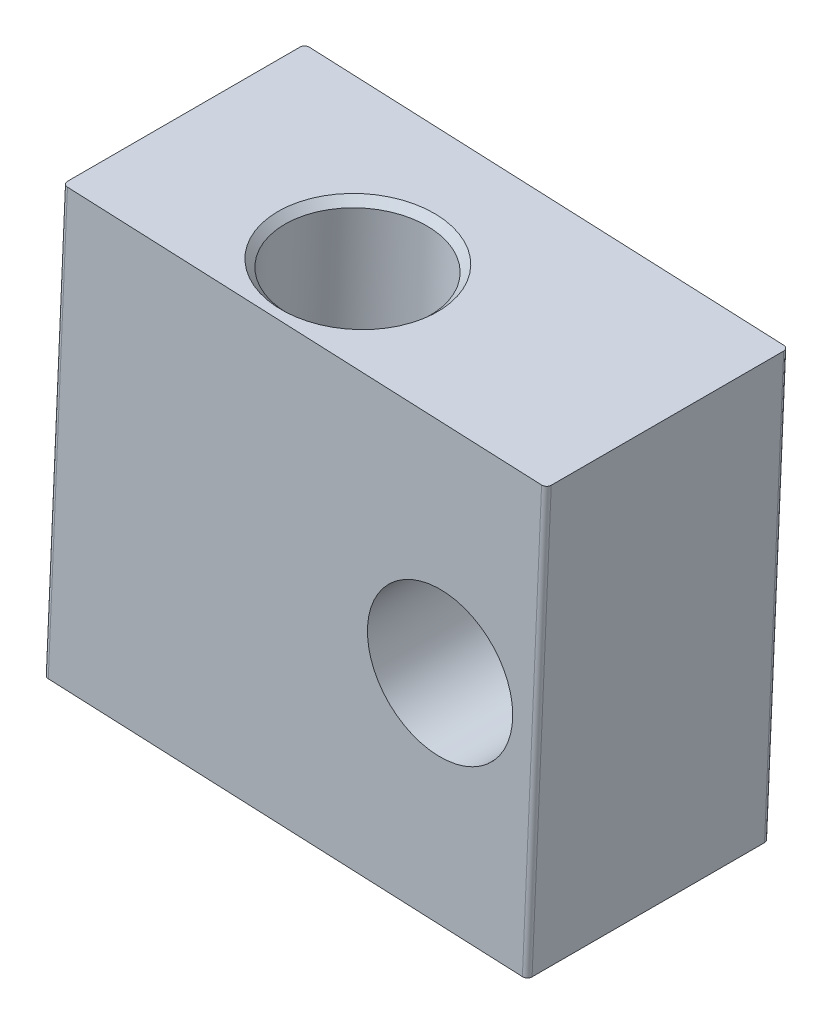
ISO-10303-21;
HEADER;
FILE_DESCRIPTION(('STEP AP214'),'2;1');
FILE_NAME('part.step','',(''),(''),'','','');
FILE_SCHEMA(('AUTOMOTIVE_DESIGN { 1 0 10303 214 1 1 1 1 }'));
ENDSEC;
DATA;
#1=APPLICATION_CONTEXT('core data for automotive mechanical design processes');
#2=APPLICATION_PROTOCOL_DEFINITION('international standard','automotive_design',2000,#1);
#3=PRODUCT_CONTEXT('',#1,'mechanical');
#4=PRODUCT('Part','Part','',(#3));
#5=PRODUCT_RELATED_PRODUCT_CATEGORY('part','',(#4));
#6=PRODUCT_DEFINITION_FORMATION('','',#4);
#7=PRODUCT_DEFINITION_CONTEXT('part definition',#1,'design');
#8=PRODUCT_DEFINITION('design','',#6,#7);
#9=PRODUCT_DEFINITION_SHAPE('','',#8);
#10=(LENGTH_UNIT() NAMED_UNIT(*) SI_UNIT(.MILLI.,.METRE.));
#11=(NAMED_UNIT(*) PLANE_ANGLE_UNIT() SI_UNIT($,.RADIAN.));
#12=(NAMED_UNIT(*) SI_UNIT($,.STERADIAN.) SOLID_ANGLE_UNIT());
#13=UNCERTAINTY_MEASURE_WITH_UNIT(LENGTH_MEASURE(1.E-05),#10,'distance_accuracy_value','');
#14=(GEOMETRIC_REPRESENTATION_CONTEXT(3) GLOBAL_UNCERTAINTY_ASSIGNED_CONTEXT((#13)) GLOBAL_UNIT_ASSIGNED_CONTEXT((#10,
#11,#12)) REPRESENTATION_CONTEXT('',''));
#15=CARTESIAN_POINT('',(0.,0.,0.));
#16=DIRECTION('',(0.,0.,1.));
#17=DIRECTION('',(1.,0.,0.));
#18=AXIS2_PLACEMENT_3D('',#15,#16,#17);
#19=CARTESIAN_POINT('',(-44.8941839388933,6.26411911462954,-33.1));
#20=DIRECTION('',(-0.0440198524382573,-0.999030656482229,0.));
#21=DIRECTION('',(0.999030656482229,-0.0440198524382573,0.));
#22=AXIS2_PLACEMENT_3D('',#19,#20,#21);
#23=PLANE('',#22);
#24=CARTESIAN_POINT('',(-49.6395795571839,6.47321341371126,-35.85));
#25=DIRECTION('',(-0.0440198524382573,-0.999030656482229,0.));
#26=DIRECTION('',(0.999030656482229,-0.0440198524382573,0.));
#27=AXIS2_PLACEMENT_3D('',#24,#25,#26);
#28=CIRCLE('',#27,1.75);
#29=CARTESIAN_POINT('',(-47.89127590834,6.39617867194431,-35.85));
#30=VERTEX_POINT('',#29);
#31=EDGE_CURVE('E20',#30,#30,#28,.T.);
#32=ORIENTED_EDGE('',*,*,#31,.T.);
#33=EDGE_LOOP('',(#32));
#34=FACE_BOUND('',#33,.T.);
#35=ADVANCED_FACE('F17',(#34),#23,.T.);
#36=CARTESIAN_POINT('',(-49.8376688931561,1.97757545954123,-35.85));
#37=DIRECTION('',(-0.0440198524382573,-0.999030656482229,0.));
#38=DIRECTION('',(0.999030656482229,-0.0440198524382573,0.));
#39=AXIS2_PLACEMENT_3D('',#36,#37,#38);
#40=CYLINDRICAL_SURFACE('',#39,1.75);
#41=ORIENTED_EDGE('',*,*,#31,.F.);
#42=EDGE_LOOP('',(#41));
#43=FACE_BOUND('',#42,.T.);
#44=CARTESIAN_POINT('',(-50.0269542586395,-2.31825636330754,-35.85));
#45=DIRECTION('',(-0.0440198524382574,-0.999030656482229,0.));
#46=DIRECTION('',(0.999030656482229,-0.0440198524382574,0.));
#47=AXIS2_PLACEMENT_3D('',#44,#45,#46);
#48=CIRCLE('',#47,1.74999999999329);
#49=CARTESIAN_POINT('',(-48.2786506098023,-2.39529110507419,-35.85));
#50=VERTEX_POINT('',#49);
#51=EDGE_CURVE('E154',#50,#50,#48,.T.);
#52=ORIENTED_EDGE('',*,*,#51,.T.);
#53=EDGE_LOOP('',(#52));
#54=FACE_BOUND('',#53,.T.);
#55=CARTESIAN_POINT('',(-51.5956554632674,1.83485627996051,-35.8500000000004));
#56=CARTESIAN_POINT('',(-51.5957780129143,1.8319946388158,-35.8957442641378));
#57=CARTESIAN_POINT('',(-51.5942565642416,1.82540516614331,-35.9413253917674));
#58=CARTESIAN_POINT('',(-51.5881875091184,1.80501591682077,-36.0307095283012));
#59=CARTESIAN_POINT('',(-51.5836319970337,1.79119732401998,-36.07450757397));
#60=CARTESIAN_POINT('',(-51.5721117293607,1.75698342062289,-36.1588838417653));
#61=CARTESIAN_POINT('',(-51.5651571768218,1.73661598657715,-36.1994748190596));
#62=CARTESIAN_POINT('',(-51.549625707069,1.6899837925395,-36.2767296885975));
#63=CARTESIAN_POINT('',(-51.5410492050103,1.6637205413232,-36.3133945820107));
#64=CARTESIAN_POINT('',(-51.5226309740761,1.60422451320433,-36.3842392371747));
#65=CARTESIAN_POINT('',(-51.5127440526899,1.57066556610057,-36.4181332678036));
#66=CARTESIAN_POINT('',(-51.4933174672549,1.49844159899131,-36.4801250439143));
#67=CARTESIAN_POINT('',(-51.4837780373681,1.45977321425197,-36.508218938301));
#68=CARTESIAN_POINT('',(-51.4657812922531,1.37581264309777,-36.5593465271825));
#69=CARTESIAN_POINT('',(-51.4574158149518,1.33026939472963,-36.5820036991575));
#70=CARTESIAN_POINT('',(-51.4438922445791,1.23555490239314,-36.6192445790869));
#71=CARTESIAN_POINT('',(-51.4387312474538,1.18638698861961,-36.6338355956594));
#72=CARTESIAN_POINT('',(-51.4329810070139,1.08961025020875,-36.6534872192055));
#73=CARTESIAN_POINT('',(-51.4320890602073,1.04214447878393,-36.6591589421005));
#74=CARTESIAN_POINT('',(-51.4344709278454,0.947040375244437,-36.6626167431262));
#75=CARTESIAN_POINT('',(-51.437742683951,0.899402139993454,-36.6604067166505));
#76=CARTESIAN_POINT('',(-51.4477182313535,0.809695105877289,-36.6487744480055));
#77=CARTESIAN_POINT('',(-51.454097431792,0.767503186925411,-36.6399987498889));
#78=CARTESIAN_POINT('',(-51.4694587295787,0.685359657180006,-36.6163689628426));
#79=CARTESIAN_POINT('',(-51.4784416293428,0.645408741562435,-36.6015129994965));
#80=CARTESIAN_POINT('',(-51.4986436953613,0.566623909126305,-36.5653262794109));
#81=CARTESIAN_POINT('',(-51.5099519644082,0.527944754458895,-36.5437098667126));
#82=CARTESIAN_POINT('',(-51.533416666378,0.454583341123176,-36.4948772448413));
#83=CARTESIAN_POINT('',(-51.5455734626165,0.419902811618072,-36.4676586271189));
#84=CARTESIAN_POINT('',(-51.5709263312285,0.351730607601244,-36.4050569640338));
#85=CARTESIAN_POINT('',(-51.5840991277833,0.318736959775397,-36.3691194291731));
#86=CARTESIAN_POINT('',(-51.6088257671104,0.259059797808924,-36.2917991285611));
#87=CARTESIAN_POINT('',(-51.6203786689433,0.232379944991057,-36.2504132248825));
#88=CARTESIAN_POINT('',(-51.6406319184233,0.18610601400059,-36.1630324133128));
#89=CARTESIAN_POINT('',(-51.6493239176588,0.166532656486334,-36.1170245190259));
#90=CARTESIAN_POINT('',(-51.6627190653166,0.135433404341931,-36.0219120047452));
#91=CARTESIAN_POINT('',(-51.6674342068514,0.123883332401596,-35.9728171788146));
#92=CARTESIAN_POINT('',(-51.671010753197,0.113043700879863,-35.8988239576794));
#93=CARTESIAN_POINT('',(-51.6716346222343,0.110503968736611,-35.874442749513));
#94=CARTESIAN_POINT('',(-51.6717517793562,0.107853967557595,-35.8320213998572));
#95=CARTESIAN_POINT('',(-51.6715004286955,0.107278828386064,-35.8140095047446));
#96=CARTESIAN_POINT('',(-51.6695246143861,0.107196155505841,-35.7500791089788));
#97=CARTESIAN_POINT('',(-51.6661212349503,0.110722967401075,-35.7041572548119));
#98=CARTESIAN_POINT('',(-51.6555732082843,0.124755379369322,-35.6137642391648));
#99=CARTESIAN_POINT('',(-51.6484191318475,0.135278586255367,-35.5692970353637));
#100=CARTESIAN_POINT('',(-51.6309971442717,0.162760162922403,-35.483280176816));
#101=CARTESIAN_POINT('',(-51.6207429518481,0.179690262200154,-35.4417186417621));
#102=CARTESIAN_POINT('',(-51.5979184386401,0.219377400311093,-35.3622130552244));
#103=CARTESIAN_POINT('',(-51.5853487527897,0.242132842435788,-35.324268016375));
#104=CARTESIAN_POINT('',(-51.5579292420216,0.294581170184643,-35.2502317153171));
#105=CARTESIAN_POINT('',(-51.5429833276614,0.324635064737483,-35.2144320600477));
#106=CARTESIAN_POINT('',(-51.512716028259,0.390110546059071,-35.1482644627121));
#107=CARTESIAN_POINT('',(-51.4973943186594,0.425536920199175,-35.1179014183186));
#108=CARTESIAN_POINT('',(-51.4665980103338,0.504030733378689,-35.061200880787));
#109=CARTESIAN_POINT('',(-51.451198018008,0.547471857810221,-35.0353356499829));
#110=CARTESIAN_POINT('',(-51.4233135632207,0.639046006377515,-34.9915512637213));
#111=CARTESIAN_POINT('',(-51.4108262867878,0.687174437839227,-34.9736244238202));
#112=CARTESIAN_POINT('',(-51.3912670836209,0.78304570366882,-34.9476780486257));
#113=CARTESIAN_POINT('',(-51.3838565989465,0.830541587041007,-34.9390109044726));
#114=CARTESIAN_POINT('',(-51.3739773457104,0.92680071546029,-34.9298317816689));
#115=CARTESIAN_POINT('',(-51.3715033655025,0.975562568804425,-34.9293111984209));
#116=CARTESIAN_POINT('',(-51.3716090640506,1.06606968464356,-34.9359638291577));
#117=CARTESIAN_POINT('',(-51.3735677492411,1.10789545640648,-34.9421356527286));
#118=CARTESIAN_POINT('',(-51.3808458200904,1.18995173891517,-34.9603190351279));
#119=CARTESIAN_POINT('',(-51.3861663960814,1.23018167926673,-34.9723326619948));
#120=CARTESIAN_POINT('',(-51.3996067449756,1.30933466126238,-35.0021702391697));
#121=CARTESIAN_POINT('',(-51.4078063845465,1.34818126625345,-35.0201590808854));
#122=CARTESIAN_POINT('',(-51.4260035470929,1.42257607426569,-35.0612944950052));
#123=CARTESIAN_POINT('',(-51.4360018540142,1.45812282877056,-35.0844433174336));
#124=CARTESIAN_POINT('',(-51.4583260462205,1.5301582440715,-35.13903051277));
#125=CARTESIAN_POINT('',(-51.4707812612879,1.56607149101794,-35.1711777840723));
#126=CARTESIAN_POINT('',(-51.4955066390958,1.63223202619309,-35.2409573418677));
#127=CARTESIAN_POINT('',(-51.5077766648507,1.66247529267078,-35.2785934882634));
#128=CARTESIAN_POINT('',(-51.5316164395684,1.7180762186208,-35.361009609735));
#129=CARTESIAN_POINT('',(-51.5431031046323,1.74304407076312,-35.4060788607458));
#130=CARTESIAN_POINT('',(-51.5632525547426,1.78466258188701,-35.500470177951));
#131=CARTESIAN_POINT('',(-51.5719196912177,1.8013260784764,-35.5497855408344));
#132=CARTESIAN_POINT('',(-51.5829614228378,1.8209814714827,-35.6322991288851));
#133=CARTESIAN_POINT('',(-51.5864777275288,1.82675062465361,-35.6647094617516));
#134=CARTESIAN_POINT('',(-51.5918605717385,1.83448494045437,-35.7300779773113));
#135=CARTESIAN_POINT('',(-51.5937302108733,1.83645725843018,-35.7630350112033));
#136=CARTESIAN_POINT('',(-51.5953049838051,1.8365302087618,-35.8140054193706));
#137=CARTESIAN_POINT('',(-51.595607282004,1.83598135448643,-35.8320153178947));
#138=CARTESIAN_POINT('',(-51.5956554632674,1.83485627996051,-35.8500000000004));
#139=B_SPLINE_CURVE_WITH_KNOTS('',3,(#55,#56,#57,#58,#59,#60,#61,#62,#63,#64,#65,#66,#67,#68,
#69,#70,#71,#72,#73,#74,#75,#76,#77,#78,#79,#80,#81,#82,#83,#84,#85,#86,#87,#88,#89,#90,#91,#92,
#93,#94,#95,#96,#97,#98,#99,#100,#101,#102,#103,#104,#105,#106,#107,#108,#109,#110,#111,#112,
#113,#114,#115,#116,#117,#118,#119,#120,#121,#122,#123,#124,#125,#126,#127,#128,#129,#130,#131,
#132,#133,#134,#135,#136,#137,#138),.UNSPECIFIED.,.T.,.F.,(4,2,2,2,2,2,2,2,2,2,2,2,2,2,2,2,2,2,
2,2,2,2,2,2,2,2,2,2,2,2,2,2,2,2,2,2,2,2,2,2,2,4),(0.,0.137440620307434,0.275240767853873,
0.412461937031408,0.549648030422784,0.695157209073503,0.840762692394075,0.994611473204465,
1.14832062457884,1.29095099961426,1.43351089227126,1.56362391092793,1.6937770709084,
1.83041328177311,1.96710835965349,2.11800802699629,2.2689949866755,2.42041871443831,
2.57138414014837,2.64484828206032,2.69888403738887,2.83663322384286,2.97473038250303,
3.11222515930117,3.24968228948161,3.39629083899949,3.54303080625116,3.70076863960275,
3.85835344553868,4.00400129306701,4.14949529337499,4.27588266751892,4.40231481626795,
4.53257458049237,4.66289125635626,4.81160434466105,4.96042252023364,5.11795537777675,
5.27524394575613,5.3743360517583,5.47324122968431,5.5272769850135),.UNSPECIFIED.);
#140=CARTESIAN_POINT('',(-51.5956554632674,1.83485627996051,-35.8500000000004));
#141=VERTEX_POINT('',#140);
#142=EDGE_CURVE('E93',#141,#141,#139,.T.);
#143=ORIENTED_EDGE('',*,*,#142,.T.);
#144=EDGE_LOOP('',(#143));
#145=FACE_BOUND('',#144,.T.);
#146=ADVANCED_FACE('F256',(#43,#54,#145),#40,.F.);
#147=CARTESIAN_POINT('',(-53.6317401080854,1.05995637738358,-35.79599699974));
#148=DIRECTION('',(-0.999030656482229,0.0440198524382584,0.));
#149=DIRECTION('',(-0.0440198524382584,-0.999030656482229,0.));
#150=AXIS2_PLACEMENT_3D('',#147,#148,#149);
#151=CYLINDRICAL_SURFACE('',#150,0.865463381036);
#152=CARTESIAN_POINT('',(-55.1302860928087,1.12598615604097,-35.79599699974));
#153=DIRECTION('',(-0.999030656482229,0.0440198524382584,0.));
#154=DIRECTION('',(-0.0440198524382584,-0.999030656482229,0.));
#155=AXIS2_PLACEMENT_3D('',#152,#153,#154);
#156=CIRCLE('',#155,0.865463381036);
#157=CARTESIAN_POINT('',(-55.1683836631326,0.261361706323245,-35.79599699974));
#158=VERTEX_POINT('',#157);
#159=EDGE_CURVE('E146',#158,#158,#156,.F.);
#160=ORIENTED_EDGE('',*,*,#159,.F.);
#161=EDGE_LOOP('',(#160));
#162=FACE_BOUND('',#161,.T.);
#163=ORIENTED_EDGE('',*,*,#142,.F.);
#164=EDGE_LOOP('',(#163));
#165=FACE_BOUND('',#164,.T.);
#166=ADVANCED_FACE('F248',(#162,#165),#151,.F.);
#167=CARTESIAN_POINT('',(-46.4587597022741,4.83160290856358,-31.8));
#168=DIRECTION('',(0.0440198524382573,0.999030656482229,0.));
#169=DIRECTION('',(-0.999030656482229,0.0440198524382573,0.));
#170=AXIS2_PLACEMENT_3D('',#167,#168,#169);
#171=CYLINDRICAL_SURFACE('',#170,3.);
#172=CARTESIAN_POINT('',(-46.7757026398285,-2.36141781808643,-31.8));
#173=DIRECTION('',(-0.0440198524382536,-0.99903065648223,0.));
#174=DIRECTION('',(0.499515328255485,-0.0220099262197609,0.866025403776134));
#175=AXIS2_PLACEMENT_3D('',#172,#173,#174);
#176=CIRCLE('',#175,2.99999999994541);
#177=CARTESIAN_POINT('',(-45.2771566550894,-2.42744759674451,-29.2019237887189));
#178=VERTEX_POINT('',#177);
#179=EDGE_CURVE('E147',#178,#178,#176,.T.);
#180=ORIENTED_EDGE('',*,*,#179,.T.);
#181=EDGE_LOOP('',(#180));
#182=FACE_BOUND('',#181,.T.);
#183=CARTESIAN_POINT('',(-46.0097572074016,15.0217156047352,-31.8));
#184=DIRECTION('',(0.0440198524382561,0.99903065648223,0.));
#185=DIRECTION('',(-0.999030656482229,0.0440198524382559,0.));
#186=AXIS2_PLACEMENT_3D('',#183,#184,#185);
#187=CIRCLE('',#186,2.99999999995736);
#188=CARTESIAN_POINT('',(-49.0068491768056,15.1537751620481,-31.8));
#189=VERTEX_POINT('',#188);
#190=EDGE_CURVE('E142',#189,#189,#187,.T.);
#191=ORIENTED_EDGE('',*,*,#190,.T.);
#192=EDGE_LOOP('',(#191));
#193=FACE_BOUND('',#192,.T.);
#194=ADVANCED_FACE('F246',(#182,#193),#171,.F.);
#195=CARTESIAN_POINT('',(-54.6846843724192,6.69551366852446,-37.9));
#196=DIRECTION('',(0.0440198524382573,0.999030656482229,0.));
#197=DIRECTION('',(-0.999030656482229,0.0440198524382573,0.));
#198=AXIS2_PLACEMENT_3D('',#195,#196,#197);
#199=CYLINDRICAL_SURFACE('',#198,0.199999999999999);
#200=CARTESIAN_POINT('',(-55.0808630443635,-2.2957622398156,-37.9));
#201=DIRECTION('',(0.0440198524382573,0.999030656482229,0.));
#202=DIRECTION('',(-0.999030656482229,0.0440198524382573,0.));
#203=AXIS2_PLACEMENT_3D('',#200,#201,#202);
#204=CIRCLE('',#203,0.199999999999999);
#205=CARTESIAN_POINT('',(-55.0808630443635,-2.29576223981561,-38.1));
#206=VERTEX_POINT('',#205);
#207=CARTESIAN_POINT('',(-55.28066917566,-2.28695826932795,-37.9));
#208=VERTEX_POINT('',#207);
#209=EDGE_CURVE('E92',#206,#208,#204,.T.);
#210=ORIENTED_EDGE('',*,*,#209,.T.);
#211=DIRECTION('',(-0.0440198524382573,-0.999030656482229,0.));
#212=VECTOR('',#211,1.);
#213=CARTESIAN_POINT('',(-54.8844905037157,6.70431763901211,-37.9));
#214=LINE('',#213,#212);
#215=CARTESIAN_POINT('',(-54.4883118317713,15.6955935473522,-37.9));
#216=VERTEX_POINT('',#215);
#217=EDGE_CURVE('E90',#216,#208,#214,.T.);
#218=ORIENTED_EDGE('',*,*,#217,.F.);
#219=CARTESIAN_POINT('',(-54.2885057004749,15.6867895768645,-37.9));
#220=DIRECTION('',(0.0440198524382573,0.999030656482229,0.));
#221=DIRECTION('',(-0.999030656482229,0.0440198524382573,0.));
#222=AXIS2_PLACEMENT_3D('',#219,#220,#221);
#223=CIRCLE('',#222,0.199999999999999);
#224=CARTESIAN_POINT('',(-54.2885057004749,15.6867895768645,-38.1));
#225=VERTEX_POINT('',#224);
#226=EDGE_CURVE('E81',#216,#225,#223,.F.);
#227=ORIENTED_EDGE('',*,*,#226,.T.);
#228=DIRECTION('',(-0.0440198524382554,-0.99903065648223,0.));
#229=VECTOR('',#228,1.);
#230=CARTESIAN_POINT('',(-54.2885057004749,15.6867895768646,-38.1));
#231=LINE('',#230,#229);
#232=EDGE_CURVE('E87',#225,#206,#231,.T.);
#233=ORIENTED_EDGE('',*,*,#232,.T.);
#234=EDGE_LOOP('',(#210,#218,#227,#233));
#235=FACE_BOUND('',#234,.T.);
#236=ADVANCED_FACE('F86',(#235),#199,.T.);
#237=CARTESIAN_POINT('',(-35.1036835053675,5.83272456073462,-37.9));
#238=DIRECTION('',(0.0440198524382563,0.999030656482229,0.));
#239=DIRECTION('',(-0.999030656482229,0.0440198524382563,0.));
#240=AXIS2_PLACEMENT_3D('',#237,#238,#239);
#241=CYLINDRICAL_SURFACE('',#240,0.199999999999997);
#242=CARTESIAN_POINT('',(-35.4998621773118,-3.15855134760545,-37.9));
#243=DIRECTION('',(0.0440198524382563,0.999030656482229,0.));
#244=DIRECTION('',(-0.999030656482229,0.0440198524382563,0.));
#245=AXIS2_PLACEMENT_3D('',#242,#243,#244);
#246=CIRCLE('',#245,0.199999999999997);
#247=CARTESIAN_POINT('',(-35.3000560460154,-3.1673553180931,-37.9));
#248=VERTEX_POINT('',#247);
#249=CARTESIAN_POINT('',(-35.4998621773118,-3.15855134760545,-38.1));
#250=VERTEX_POINT('',#249);
#251=EDGE_CURVE('E156',#248,#250,#246,.T.);
#252=ORIENTED_EDGE('',*,*,#251,.T.);
#253=DIRECTION('',(0.0440198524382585,0.999030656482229,0.));
#254=VECTOR('',#253,1.);
#255=CARTESIAN_POINT('',(-35.4998621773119,-3.15855134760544,-38.1));
#256=LINE('',#255,#254);
#257=CARTESIAN_POINT('',(-34.7075048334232,14.8240004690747,-38.1));
#258=VERTEX_POINT('',#257);
#259=EDGE_CURVE('E102',#250,#258,#256,.T.);
#260=ORIENTED_EDGE('',*,*,#259,.T.);
#261=CARTESIAN_POINT('',(-34.7075048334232,14.8240004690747,-37.9));
#262=DIRECTION('',(0.0440198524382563,0.999030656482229,0.));
#263=DIRECTION('',(-0.999030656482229,0.0440198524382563,0.));
#264=AXIS2_PLACEMENT_3D('',#261,#262,#263);
#265=CIRCLE('',#264,0.199999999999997);
#266=CARTESIAN_POINT('',(-34.5076987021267,14.815196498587,-37.9));
#267=VERTEX_POINT('',#266);
#268=EDGE_CURVE('E107',#258,#267,#265,.F.);
#269=ORIENTED_EDGE('',*,*,#268,.T.);
#270=DIRECTION('',(0.0440198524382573,0.999030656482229,0.));
#271=VECTOR('',#270,1.);
#272=CARTESIAN_POINT('',(-34.903877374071,5.82392059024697,-37.9));
#273=LINE('',#272,#271);
#274=EDGE_CURVE('E103',#248,#267,#273,.T.);
#275=ORIENTED_EDGE('',*,*,#274,.F.);
#276=EDGE_LOOP('',(#252,#260,#269,#275));
#277=FACE_BOUND('',#276,.T.);
#278=ADVANCED_FACE('F194',(#277),#241,.T.);
#279=CARTESIAN_POINT('',(-50.0357582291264,-2.51806249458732,-35.85));
#280=DIRECTION('',(-0.0440198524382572,-0.999030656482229,0.));
#281=DIRECTION('',(0.999030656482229,-0.0440198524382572,0.));
#282=AXIS2_PLACEMENT_3D('',#279,#280,#281);
#283=CONICAL_SURFACE('',#282,1.94999999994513,0.785398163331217);
#284=CARTESIAN_POINT('',(-50.0357582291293,-2.51806249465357,-35.85));
#285=DIRECTION('',(-0.0440198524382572,-0.999030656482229,0.));
#286=DIRECTION('',(0.999030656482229,-0.0440198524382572,0.));
#287=AXIS2_PLACEMENT_3D('',#284,#285,#286);
#288=CIRCLE('',#287,1.95000000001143);
#289=CARTESIAN_POINT('',(-49.1298236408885,-2.55798029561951,-34.1236775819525));
#290=VERTEX_POINT('',#289);
#291=CARTESIAN_POINT('',(-48.5482474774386,-2.58360603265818,-34.5908273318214));
#292=VERTEX_POINT('',#291);
#293=EDGE_CURVE('E132',#290,#292,#288,.T.);
#294=ORIENTED_EDGE('',*,*,#293,.T.);
#295=CARTESIAN_POINT('',(-48.5482474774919,-2.58360603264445,-34.5908273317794));
#296=CARTESIAN_POINT('',(-48.5945051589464,-2.5720917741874,-34.5501806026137));
#297=CARTESIAN_POINT('',(-48.641540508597,-2.5628451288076,-34.5097570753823));
#298=CARTESIAN_POINT('',(-48.7365979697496,-2.54909135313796,-34.4298791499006));
#299=CARTESIAN_POINT('',(-48.7846121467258,-2.5445551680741,-34.3904202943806));
#300=CARTESIAN_POINT('',(-48.8816395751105,-2.54027989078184,-34.3124832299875));
#301=CARTESIAN_POINT('',(-48.9306528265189,-2.54054079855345,-34.2740050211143));
#302=CARTESIAN_POINT('',(-49.0296583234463,-2.54574366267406,-34.1980023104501));
#303=CARTESIAN_POINT('',(-49.0796547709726,-2.55071483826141,-34.1604852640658));
#304=CARTESIAN_POINT('',(-49.1298236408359,-2.55798029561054,-34.1236775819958));
#305=B_SPLINE_CURVE_WITH_KNOTS('',3,(#295,#296,#297,#298,#299,#300,#301,#302,#303,#304),
.UNSPECIFIED.,.F.,.F.,(4,2,2,2,4),(0.,0.187911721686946,0.374657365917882,0.561403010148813,
0.749314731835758),.UNSPECIFIED.);
#306=EDGE_CURVE('E153',#292,#290,#305,.T.);
#307=ORIENTED_EDGE('',*,*,#306,.T.);
#308=EDGE_LOOP('',(#294,#307));
#309=FACE_BOUND('',#308,.T.);
#310=ORIENTED_EDGE('',*,*,#51,.F.);
#311=EDGE_LOOP('',(#310));
#312=FACE_BOUND('',#311,.T.);
#313=ADVANCED_FACE('F190',(#309,#312),#283,.F.);
#314=CARTESIAN_POINT('',(-46.7889085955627,-2.66112701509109,-31.8));
#315=DIRECTION('',(-0.0440198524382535,-0.99903065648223,0.));
#316=DIRECTION('',(0.99903065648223,-0.0440198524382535,0.));
#317=AXIS2_PLACEMENT_3D('',#314,#315,#316);
#318=CONICAL_SURFACE('',#317,3.30000000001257,0.785398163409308);
#319=ORIENTED_EDGE('',*,*,#179,.F.);
#320=EDGE_LOOP('',(#319));
#321=FACE_BOUND('',#320,.T.);
#322=ORIENTED_EDGE('',*,*,#306,.F.);
#323=CARTESIAN_POINT('',(-46.7889085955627,-2.66112701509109,-31.8));
#324=DIRECTION('',(-0.0440198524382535,-0.99903065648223,0.));
#325=DIRECTION('',(0.99903065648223,-0.0440198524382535,0.));
#326=AXIS2_PLACEMENT_3D('',#323,#324,#325);
#327=CIRCLE('',#326,3.30000000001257);
#328=EDGE_CURVE('E144',#292,#290,#327,.T.);
#329=ORIENTED_EDGE('',*,*,#328,.T.);
#330=EDGE_LOOP('',(#322,#329));
#331=FACE_BOUND('',#330,.T.);
#332=ADVANCED_FACE('F185',(#321,#331),#318,.F.);
#333=CARTESIAN_POINT('',(-54.8844905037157,6.70431763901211,-38.1));
#334=DIRECTION('',(-0.999030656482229,0.0440198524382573,0.));
#335=DIRECTION('',(-0.0440198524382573,-0.999030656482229,0.));
#336=AXIS2_PLACEMENT_3D('',#333,#334,#335);
#337=PLANE('',#336);
#338=ORIENTED_EDGE('',*,*,#159,.T.);
#339=EDGE_LOOP('',(#338));
#340=FACE_BOUND('',#339,.T.);
#341=DIRECTION('',(0.,0.,1.));
#342=VECTOR('',#341,1.);
#343=CARTESIAN_POINT('',(-54.4883118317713,15.6955935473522,-33.1));
#344=LINE('',#343,#342);
#345=CARTESIAN_POINT('',(-54.4883118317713,15.6955935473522,-28.3));
#346=VERTEX_POINT('',#345);
#347=EDGE_CURVE('E109',#216,#346,#344,.T.);
#348=ORIENTED_EDGE('',*,*,#347,.F.);
#349=ORIENTED_EDGE('',*,*,#217,.T.);
#350=DIRECTION('',(0.,0.,1.));
#351=VECTOR('',#350,1.);
#352=CARTESIAN_POINT('',(-55.28066917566,-2.28695826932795,-33.1));
#353=LINE('',#352,#351);
#354=CARTESIAN_POINT('',(-55.28066917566,-2.28695826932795,-28.3));
#355=VERTEX_POINT('',#354);
#356=EDGE_CURVE('E133',#208,#355,#353,.T.);
#357=ORIENTED_EDGE('',*,*,#356,.T.);
#358=DIRECTION('',(0.0440198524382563,0.999030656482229,0.));
#359=VECTOR('',#358,1.);
#360=CARTESIAN_POINT('',(-54.8844905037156,6.70431763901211,-28.3));
#361=LINE('',#360,#359);
#362=EDGE_CURVE('E114',#346,#355,#361,.F.);
#363=ORIENTED_EDGE('',*,*,#362,.F.);
#364=EDGE_LOOP('',(#348,#349,#357,#363));
#365=FACE_BOUND('',#364,.T.);
#366=ADVANCED_FACE('F189',(#340,#365),#337,.T.);
#367=CARTESIAN_POINT('',(-45.9965512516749,15.321424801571,-31.8));
#368=DIRECTION('',(0.0440198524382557,0.99903065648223,0.));
#369=DIRECTION('',(-0.999030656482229,0.0440198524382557,0.));
#370=AXIS2_PLACEMENT_3D('',#367,#368,#369);
#371=CONICAL_SURFACE('',#370,3.29999999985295,0.785398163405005);
#372=CARTESIAN_POINT('',(-45.9965512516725,15.321424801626,-31.8));
#373=DIRECTION('',(0.0440198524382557,0.99903065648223,0.));
#374=DIRECTION('',(-0.999030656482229,0.0440198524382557,0.));
#375=AXIS2_PLACEMENT_3D('',#372,#373,#374);
#376=CIRCLE('',#375,3.29999999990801);
#377=CARTESIAN_POINT('',(-49.2933524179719,15.4666903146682,-31.8));
#378=VERTEX_POINT('',#377);
#379=EDGE_CURVE('E163',#378,#378,#376,.F.);
#380=ORIENTED_EDGE('',*,*,#379,.F.);
#381=EDGE_LOOP('',(#380));
#382=FACE_BOUND('',#381,.T.);
#383=ORIENTED_EDGE('',*,*,#190,.F.);
#384=EDGE_LOOP('',(#383));
#385=FACE_BOUND('',#384,.T.);
#386=ADVANCED_FACE('F234',(#382,#385),#371,.F.);
#387=CARTESIAN_POINT('',(-34.903877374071,5.82392059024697,-28.1));
#388=DIRECTION('',(0.999030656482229,-0.0440198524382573,0.));
#389=DIRECTION('',(0.0440198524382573,0.999030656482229,0.));
#390=AXIS2_PLACEMENT_3D('',#387,#388,#389);
#391=PLANE('',#390);
#392=DIRECTION('',(0.,0.,1.));
#393=VECTOR('',#392,1.);
#394=CARTESIAN_POINT('',(-35.3000560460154,-3.1673553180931,-33.1));
#395=LINE('',#394,#393);
#396=CARTESIAN_POINT('',(-35.3000560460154,-3.16735531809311,-28.3));
#397=VERTEX_POINT('',#396);
#398=EDGE_CURVE('E129',#397,#248,#395,.F.);
#399=ORIENTED_EDGE('',*,*,#398,.T.);
#400=ORIENTED_EDGE('',*,*,#274,.T.);
#401=DIRECTION('',(0.,0.,1.));
#402=VECTOR('',#401,1.);
#403=CARTESIAN_POINT('',(-34.5076987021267,14.815196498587,-33.1));
#404=LINE('',#403,#402);
#405=CARTESIAN_POINT('',(-34.5076987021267,14.815196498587,-28.3));
#406=VERTEX_POINT('',#405);
#407=EDGE_CURVE('E166',#406,#267,#404,.F.);
#408=ORIENTED_EDGE('',*,*,#407,.F.);
#409=DIRECTION('',(0.0440198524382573,0.999030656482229,0.));
#410=VECTOR('',#409,1.);
#411=CARTESIAN_POINT('',(-34.9038773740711,5.82392059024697,-28.3));
#412=LINE('',#411,#410);
#413=EDGE_CURVE('E137',#397,#406,#412,.T.);
#414=ORIENTED_EDGE('',*,*,#413,.F.);
#415=EDGE_LOOP('',(#399,#400,#408,#414));
#416=FACE_BOUND('',#415,.T.);
#417=ADVANCED_FACE('F231',(#416),#391,.T.);
#418=CARTESIAN_POINT('',(-54.8844905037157,6.70431763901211,-38.1));
#419=DIRECTION('',(0.,0.,1.));
#420=DIRECTION('',(1.,0.,0.));
#421=AXIS2_PLACEMENT_3D('',#418,#419,#420);
#422=PLANE('',#421);
#423=CARTESIAN_POINT('',(-38.9,6.,-38.1));
#424=DIRECTION('',(0.,0.,1.));
#425=DIRECTION('',(1.,0.,0.));
#426=AXIS2_PLACEMENT_3D('',#423,#424,#425);
#427=CIRCLE('',#426,3.);
#428=CARTESIAN_POINT('',(-35.9,6.,-38.1));
#429=VERTEX_POINT('',#428);
#430=EDGE_CURVE('E128',#429,#429,#427,.T.);
#431=ORIENTED_EDGE('',*,*,#430,.T.);
#432=EDGE_LOOP('',(#431));
#433=FACE_BOUND('',#432,.T.);
#434=DIRECTION('',(-0.999030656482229,0.0440198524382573,0.));
#435=VECTOR('',#434,1.);
#436=CARTESIAN_POINT('',(-45.2903626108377,-2.72715679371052,-38.1));
#437=LINE('',#436,#435);
#438=EDGE_CURVE('E101',#250,#206,#437,.T.);
#439=ORIENTED_EDGE('',*,*,#438,.T.);
#440=ORIENTED_EDGE('',*,*,#232,.F.);
#441=DIRECTION('',(-0.999030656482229,0.0440198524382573,0.));
#442=VECTOR('',#441,1.);
#443=CARTESIAN_POINT('',(-44.4980052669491,15.2553950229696,-38.1));
#444=LINE('',#443,#442);
#445=EDGE_CURVE('E99',#258,#225,#444,.T.);
#446=ORIENTED_EDGE('',*,*,#445,.F.);
#447=ORIENTED_EDGE('',*,*,#259,.F.);
#448=EDGE_LOOP('',(#439,#440,#446,#447));
#449=FACE_BOUND('',#448,.T.);
#450=ADVANCED_FACE('F97',(#433,#449),#422,.F.);
#451=CARTESIAN_POINT('',(-45.2903626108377,-2.72715679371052,-33.1));
#452=DIRECTION('',(0.0440198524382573,0.999030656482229,0.));
#453=DIRECTION('',(-0.999030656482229,0.0440198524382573,0.));
#454=AXIS2_PLACEMENT_3D('',#451,#452,#453);
#455=PLANE('',#454);
#456=ORIENTED_EDGE('',*,*,#328,.F.);
#457=ORIENTED_EDGE('',*,*,#293,.F.);
#458=EDGE_LOOP('',(#456,#457));
#459=FACE_BOUND('',#458,.T.);
#460=ORIENTED_EDGE('',*,*,#398,.F.);
#461=CARTESIAN_POINT('',(-35.4998621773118,-3.15855134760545,-28.3));
#462=DIRECTION('',(0.0440198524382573,0.999030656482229,0.));
#463=DIRECTION('',(-0.999030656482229,0.0440198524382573,0.));
#464=AXIS2_PLACEMENT_3D('',#461,#462,#463);
#465=CIRCLE('',#464,0.199999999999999);
#466=CARTESIAN_POINT('',(-35.4998621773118,-3.15855134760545,-28.1));
#467=VERTEX_POINT('',#466);
#468=EDGE_CURVE('E139',#467,#397,#465,.T.);
#469=ORIENTED_EDGE('',*,*,#468,.F.);
#470=DIRECTION('',(-0.999030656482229,0.0440198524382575,0.));
#471=VECTOR('',#470,1.);
#472=CARTESIAN_POINT('',(-35.4998621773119,-3.15855134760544,-28.1));
#473=LINE('',#472,#471);
#474=CARTESIAN_POINT('',(-55.0808630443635,-2.29576223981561,-28.1));
#475=VERTEX_POINT('',#474);
#476=EDGE_CURVE('E122',#467,#475,#473,.T.);
#477=ORIENTED_EDGE('',*,*,#476,.T.);
#478=CARTESIAN_POINT('',(-55.0808630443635,-2.29576223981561,-28.3));
#479=DIRECTION('',(0.0440198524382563,0.999030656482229,0.));
#480=DIRECTION('',(-0.999030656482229,0.0440198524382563,0.));
#481=AXIS2_PLACEMENT_3D('',#478,#479,#480);
#482=CIRCLE('',#481,0.199999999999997);
#483=EDGE_CURVE('E110',#355,#475,#482,.T.);
#484=ORIENTED_EDGE('',*,*,#483,.F.);
#485=ORIENTED_EDGE('',*,*,#356,.F.);
#486=ORIENTED_EDGE('',*,*,#209,.F.);
#487=ORIENTED_EDGE('',*,*,#438,.F.);
#488=ORIENTED_EDGE('',*,*,#251,.F.);
#489=EDGE_LOOP('',(#460,#469,#477,#484,#485,#486,#487,#488));
#490=FACE_BOUND('',#489,.T.);
#491=ADVANCED_FACE('F224',(#459,#490),#455,.F.);
#492=CARTESIAN_POINT('',(-54.6846843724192,6.69551366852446,-28.3));
#493=DIRECTION('',(0.0440198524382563,0.999030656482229,0.));
#494=DIRECTION('',(-0.999030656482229,0.0440198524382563,0.));
#495=AXIS2_PLACEMENT_3D('',#492,#493,#494);
#496=CYLINDRICAL_SURFACE('',#495,0.199999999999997);
#497=ORIENTED_EDGE('',*,*,#483,.T.);
#498=DIRECTION('',(0.0440198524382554,0.99903065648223,0.));
#499=VECTOR('',#498,1.);
#500=CARTESIAN_POINT('',(-55.0808630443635,-2.2957622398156,-28.1));
#501=LINE('',#500,#499);
#502=CARTESIAN_POINT('',(-54.2885057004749,15.6867895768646,-28.1));
#503=VERTEX_POINT('',#502);
#504=EDGE_CURVE('E118',#475,#503,#501,.T.);
#505=ORIENTED_EDGE('',*,*,#504,.T.);
#506=CARTESIAN_POINT('',(-54.2885057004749,15.6867895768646,-28.3));
#507=DIRECTION('',(0.0440198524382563,0.999030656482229,0.));
#508=DIRECTION('',(-0.999030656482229,0.0440198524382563,0.));
#509=AXIS2_PLACEMENT_3D('',#506,#507,#508);
#510=CIRCLE('',#509,0.199999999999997);
#511=EDGE_CURVE('E112',#346,#503,#510,.T.);
#512=ORIENTED_EDGE('',*,*,#511,.F.);
#513=ORIENTED_EDGE('',*,*,#362,.T.);
#514=EDGE_LOOP('',(#497,#505,#512,#513));
#515=FACE_BOUND('',#514,.T.);
#516=ADVANCED_FACE('F220',(#515),#496,.T.);
#517=CARTESIAN_POINT('',(-44.4980052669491,15.2553950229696,-33.1));
#518=DIRECTION('',(0.0440198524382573,0.999030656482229,0.));
#519=DIRECTION('',(-0.999030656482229,0.0440198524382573,0.));
#520=AXIS2_PLACEMENT_3D('',#517,#518,#519);
#521=PLANE('',#520);
#522=ORIENTED_EDGE('',*,*,#379,.T.);
#523=EDGE_LOOP('',(#522));
#524=FACE_BOUND('',#523,.T.);
#525=ORIENTED_EDGE('',*,*,#407,.T.);
#526=ORIENTED_EDGE('',*,*,#268,.F.);
#527=ORIENTED_EDGE('',*,*,#445,.T.);
#528=ORIENTED_EDGE('',*,*,#226,.F.);
#529=ORIENTED_EDGE('',*,*,#347,.T.);
#530=ORIENTED_EDGE('',*,*,#511,.T.);
#531=DIRECTION('',(0.999030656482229,-0.0440198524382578,0.));
#532=VECTOR('',#531,1.);
#533=CARTESIAN_POINT('',(-54.2885057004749,15.6867895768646,-28.1));
#534=LINE('',#533,#532);
#535=CARTESIAN_POINT('',(-34.7075048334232,14.8240004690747,-28.1));
#536=VERTEX_POINT('',#535);
#537=EDGE_CURVE('E121',#503,#536,#534,.T.);
#538=ORIENTED_EDGE('',*,*,#537,.T.);
#539=CARTESIAN_POINT('',(-34.7075048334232,14.8240004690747,-28.3));
#540=DIRECTION('',(0.0440198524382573,0.999030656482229,0.));
#541=DIRECTION('',(-0.999030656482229,0.0440198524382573,0.));
#542=AXIS2_PLACEMENT_3D('',#539,#540,#541);
#543=CIRCLE('',#542,0.199999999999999);
#544=EDGE_CURVE('E35',#406,#536,#543,.F.);
#545=ORIENTED_EDGE('',*,*,#544,.F.);
#546=EDGE_LOOP('',(#525,#526,#527,#528,#529,#530,#538,#545));
#547=FACE_BOUND('',#546,.T.);
#548=ADVANCED_FACE('F106',(#524,#547),#521,.T.);
#549=CARTESIAN_POINT('',(-35.1036835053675,5.83272456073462,-28.3));
#550=DIRECTION('',(0.0440198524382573,0.999030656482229,0.));
#551=DIRECTION('',(-0.999030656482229,0.0440198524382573,0.));
#552=AXIS2_PLACEMENT_3D('',#549,#550,#551);
#553=CYLINDRICAL_SURFACE('',#552,0.199999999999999);
#554=ORIENTED_EDGE('',*,*,#468,.T.);
#555=ORIENTED_EDGE('',*,*,#413,.T.);
#556=ORIENTED_EDGE('',*,*,#544,.T.);
#557=DIRECTION('',(-0.0440198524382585,-0.999030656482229,0.));
#558=VECTOR('',#557,1.);
#559=CARTESIAN_POINT('',(-34.7075048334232,14.8240004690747,-28.1));
#560=LINE('',#559,#558);
#561=EDGE_CURVE('E26',#536,#467,#560,.T.);
#562=ORIENTED_EDGE('',*,*,#561,.T.);
#563=EDGE_LOOP('',(#554,#555,#556,#562));
#564=FACE_BOUND('',#563,.T.);
#565=ADVANCED_FACE('F210',(#564),#553,.T.);
#566=CARTESIAN_POINT('',(-38.9,6.,-33.1));
#567=DIRECTION('',(0.,0.,1.));
#568=DIRECTION('',(1.,0.,0.));
#569=AXIS2_PLACEMENT_3D('',#566,#567,#568);
#570=CYLINDRICAL_SURFACE('',#569,3.);
#571=CARTESIAN_POINT('',(-38.9,6.,-28.1));
#572=DIRECTION('',(0.,0.,1.));
#573=DIRECTION('',(1.,0.,0.));
#574=AXIS2_PLACEMENT_3D('',#571,#572,#573);
#575=CIRCLE('',#574,3.);
#576=CARTESIAN_POINT('',(-35.9,6.,-28.1));
#577=VERTEX_POINT('',#576);
#578=EDGE_CURVE('E11',#577,#577,#575,.T.);
#579=ORIENTED_EDGE('',*,*,#578,.T.);
#580=EDGE_LOOP('',(#579));
#581=FACE_BOUND('',#580,.T.);
#582=ORIENTED_EDGE('',*,*,#430,.F.);
#583=EDGE_LOOP('',(#582));
#584=FACE_BOUND('',#583,.T.);
#585=ADVANCED_FACE('F204',(#581,#584),#570,.F.);
#586=CARTESIAN_POINT('',(-34.903877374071,5.82392059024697,-28.1));
#587=DIRECTION('',(0.,0.,-1.));
#588=DIRECTION('',(-1.,0.,0.));
#589=AXIS2_PLACEMENT_3D('',#586,#587,#588);
#590=PLANE('',#589);
#591=ORIENTED_EDGE('',*,*,#578,.F.);
#592=EDGE_LOOP('',(#591));
#593=FACE_BOUND('',#592,.T.);
#594=ORIENTED_EDGE('',*,*,#537,.F.);
#595=ORIENTED_EDGE('',*,*,#504,.F.);
#596=ORIENTED_EDGE('',*,*,#476,.F.);
#597=ORIENTED_EDGE('',*,*,#561,.F.);
#598=EDGE_LOOP('',(#594,#595,#596,#597));
#599=FACE_BOUND('',#598,.T.);
#600=ADVANCED_FACE('F202',(#593,#599),#590,.F.);
#601=CLOSED_SHELL('',(#35,#146,#166,#194,#236,#278,#313,#332,#366,#386,#417,#450,#491,#516,#548,
#565,#585,#600));
#602=MANIFOLD_SOLID_BREP('B1',#601);
#603=ADVANCED_BREP_SHAPE_REPRESENTATION('',(#18,#602),#14);
#604=SHAPE_DEFINITION_REPRESENTATION(#9,#603);
ENDSEC;
END-ISO-10303-21;
